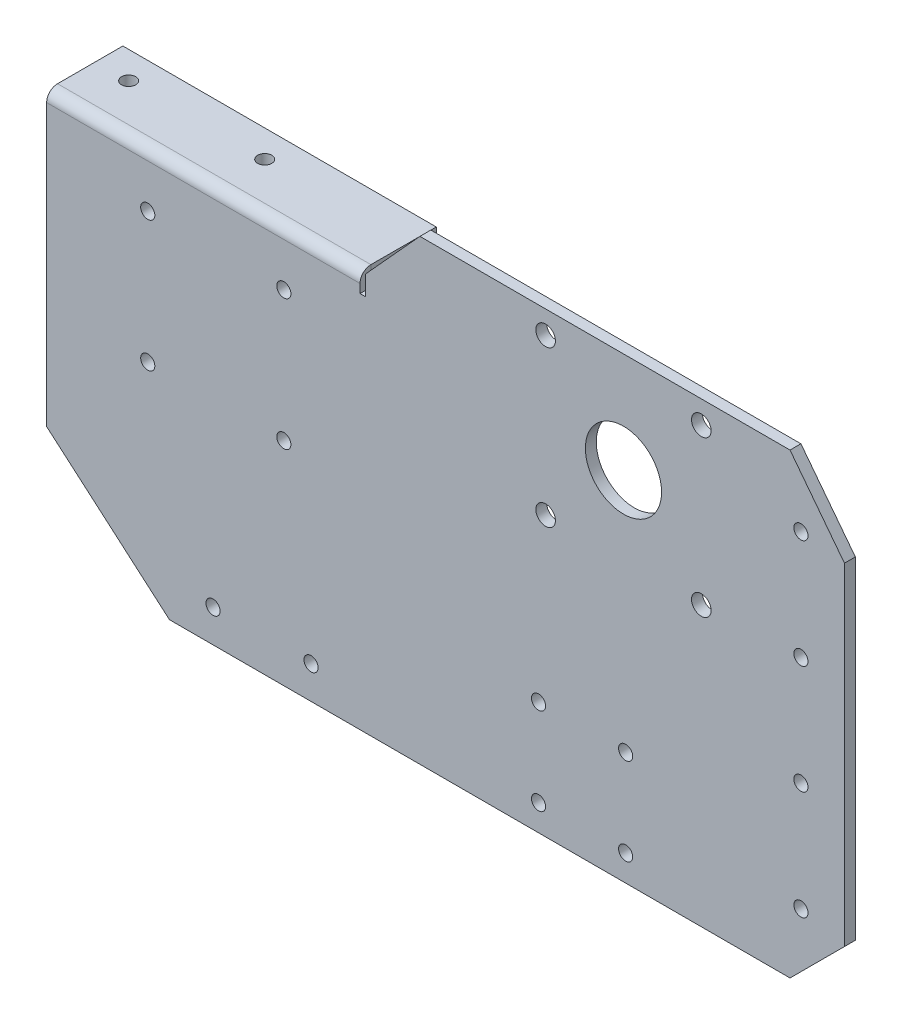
ISO-10303-21;
HEADER;
FILE_DESCRIPTION(('STEP AP214'),'2;1');
FILE_NAME('part.step','',(''),(''),'','','');
FILE_SCHEMA(('AUTOMOTIVE_DESIGN { 1 0 10303 214 1 1 1 1 }'));
ENDSEC;
DATA;
#1=APPLICATION_CONTEXT('core data for automotive mechanical design processes');
#2=APPLICATION_PROTOCOL_DEFINITION('international standard','automotive_design',2000,#1);
#3=PRODUCT_CONTEXT('',#1,'mechanical');
#4=PRODUCT('Part','Part','',(#3));
#5=PRODUCT_RELATED_PRODUCT_CATEGORY('part','',(#4));
#6=PRODUCT_DEFINITION_FORMATION('','',#4);
#7=PRODUCT_DEFINITION_CONTEXT('part definition',#1,'design');
#8=PRODUCT_DEFINITION('design','',#6,#7);
#9=PRODUCT_DEFINITION_SHAPE('','',#8);
#10=(LENGTH_UNIT() NAMED_UNIT(*) SI_UNIT(.MILLI.,.METRE.));
#11=(NAMED_UNIT(*) PLANE_ANGLE_UNIT() SI_UNIT($,.RADIAN.));
#12=(NAMED_UNIT(*) SI_UNIT($,.STERADIAN.) SOLID_ANGLE_UNIT());
#13=UNCERTAINTY_MEASURE_WITH_UNIT(LENGTH_MEASURE(1.E-05),#10,'distance_accuracy_value','');
#14=(GEOMETRIC_REPRESENTATION_CONTEXT(3) GLOBAL_UNCERTAINTY_ASSIGNED_CONTEXT((#13)) GLOBAL_UNIT_ASSIGNED_CONTEXT((#10,
#11,#12)) REPRESENTATION_CONTEXT('',''));
#15=CARTESIAN_POINT('',(0.,0.,0.));
#16=DIRECTION('',(0.,0.,1.));
#17=DIRECTION('',(1.,0.,0.));
#18=AXIS2_PLACEMENT_3D('',#15,#16,#17);
#19=CARTESIAN_POINT('',(67.1428269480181,97.1807045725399,-1145.39074847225));
#20=DIRECTION('',(-1.,0.,0.));
#21=DIRECTION('',(0.,0.,1.));
#22=AXIS2_PLACEMENT_3D('',#19,#20,#21);
#23=PLANE('',#22);
#24=DIRECTION('',(0.,0.,1.));
#25=VECTOR('',#24,1.);
#26=CARTESIAN_POINT('',(67.1428269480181,97.1807045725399,-1145.39074847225));
#27=LINE('',#26,#25);
#28=CARTESIAN_POINT('',(67.1428269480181,97.1807045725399,0.));
#29=VERTEX_POINT('',#28);
#30=CARTESIAN_POINT('',(67.1428269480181,97.1807045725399,10.));
#31=VERTEX_POINT('',#30);
#32=EDGE_CURVE('E54',#29,#31,#27,.T.);
#33=ORIENTED_EDGE('',*,*,#32,.T.);
#34=DIRECTION('',(0.,1.,0.));
#35=VECTOR('',#34,1.);
#36=CARTESIAN_POINT('',(67.1428269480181,73.3276118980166,10.));
#37=LINE('',#36,#35);
#38=CARTESIAN_POINT('',(67.1428269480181,354.999,10.));
#39=VERTEX_POINT('',#38);
#40=EDGE_CURVE('E47',#31,#39,#37,.T.);
#41=ORIENTED_EDGE('',*,*,#40,.T.);
#42=CARTESIAN_POINT('',(67.1428269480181,354.999,0.));
#43=DIRECTION('',(-1.,0.,0.));
#44=DIRECTION('',(0.,0.,1.));
#45=AXIS2_PLACEMENT_3D('',#42,#43,#44);
#46=CIRCLE('',#45,10.);
#47=CARTESIAN_POINT('',(67.1428269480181,364.999,0.));
#48=VERTEX_POINT('',#47);
#49=EDGE_CURVE('E165',#48,#39,#46,.F.);
#50=ORIENTED_EDGE('',*,*,#49,.F.);
#51=DIRECTION('',(0.,0.,-1.));
#52=VECTOR('',#51,1.);
#53=CARTESIAN_POINT('',(67.1428269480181,364.999,10.));
#54=LINE('',#53,#52);
#55=CARTESIAN_POINT('',(67.1428269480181,364.999,-60.));
#56=VERTEX_POINT('',#55);
#57=EDGE_CURVE('E166',#48,#56,#54,.T.);
#58=ORIENTED_EDGE('',*,*,#57,.T.);
#59=DIRECTION('',(0.,1.,0.));
#60=VECTOR('',#59,1.);
#61=CARTESIAN_POINT('',(67.1428269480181,354.999,-60.));
#62=LINE('',#61,#60);
#63=CARTESIAN_POINT('',(67.142826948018,354.999,-60.));
#64=VERTEX_POINT('',#63);
#65=EDGE_CURVE('E172',#64,#56,#62,.T.);
#66=ORIENTED_EDGE('',*,*,#65,.F.);
#67=DIRECTION('',(0.,0.,1.));
#68=VECTOR('',#67,1.);
#69=CARTESIAN_POINT('',(67.142826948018,354.999,10.));
#70=LINE('',#69,#68);
#71=CARTESIAN_POINT('',(67.142826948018,354.999,-10.));
#72=VERTEX_POINT('',#71);
#73=EDGE_CURVE('E170',#64,#72,#70,.T.);
#74=ORIENTED_EDGE('',*,*,#73,.T.);
#75=CARTESIAN_POINT('',(67.1428269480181,344.999,-10.));
#76=DIRECTION('',(-1.,0.,0.));
#77=DIRECTION('',(0.,0.,1.));
#78=AXIS2_PLACEMENT_3D('',#75,#76,#77);
#79=CIRCLE('',#78,10.);
#80=CARTESIAN_POINT('',(67.1428269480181,344.999,0.));
#81=VERTEX_POINT('',#80);
#82=EDGE_CURVE('E11',#72,#81,#79,.F.);
#83=ORIENTED_EDGE('',*,*,#82,.T.);
#84=DIRECTION('',(0.,1.,0.));
#85=VECTOR('',#84,1.);
#86=CARTESIAN_POINT('',(67.1428269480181,73.3276118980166,0.));
#87=LINE('',#86,#85);
#88=EDGE_CURVE('E160',#29,#81,#87,.T.);
#89=ORIENTED_EDGE('',*,*,#88,.F.);
#90=EDGE_LOOP('',(#33,#41,#50,#58,#66,#74,#83,#89));
#91=FACE_BOUND('',#90,.T.);
#92=ADVANCED_FACE('F32',(#91),#23,.T.);
#93=CARTESIAN_POINT('',(94.8431926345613,73.3276118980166,10.));
#94=DIRECTION('',(0.,0.,-1.));
#95=DIRECTION('',(-1.,0.,0.));
#96=AXIS2_PLACEMENT_3D('',#93,#94,#95);
#97=PLANE('',#96);
#98=CARTESIAN_POINT('',(759.999,59.999,10.));
#99=DIRECTION('',(0.,0.,1.));
#100=DIRECTION('',(1.,0.,0.));
#101=AXIS2_PLACEMENT_3D('',#98,#99,#100);
#102=CIRCLE('',#101,6.49999999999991);
#103=CARTESIAN_POINT('',(766.499,59.999,10.));
#104=VERTEX_POINT('',#103);
#105=EDGE_CURVE('E208',#104,#104,#102,.T.);
#106=ORIENTED_EDGE('',*,*,#105,.F.);
#107=EDGE_LOOP('',(#106));
#108=FACE_BOUND('',#107,.T.);
#109=CARTESIAN_POINT('',(284.999,314.999,10.));
#110=DIRECTION('',(0.,0.,1.));
#111=DIRECTION('',(1.,0.,0.));
#112=AXIS2_PLACEMENT_3D('',#109,#110,#111);
#113=CIRCLE('',#112,6.50000000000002);
#114=CARTESIAN_POINT('',(291.499,314.999,10.));
#115=VERTEX_POINT('',#114);
#116=EDGE_CURVE('E220',#115,#115,#113,.T.);
#117=ORIENTED_EDGE('',*,*,#116,.F.);
#118=EDGE_LOOP('',(#117));
#119=FACE_BOUND('',#118,.T.);
#120=CARTESIAN_POINT('',(159.999,194.999,10.));
#121=DIRECTION('',(0.,0.,1.));
#122=DIRECTION('',(1.,0.,0.));
#123=AXIS2_PLACEMENT_3D('',#120,#121,#122);
#124=CIRCLE('',#123,6.50000000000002);
#125=CARTESIAN_POINT('',(166.499,194.999,10.));
#126=VERTEX_POINT('',#125);
#127=EDGE_CURVE('E238',#126,#126,#124,.T.);
#128=ORIENTED_EDGE('',*,*,#127,.F.);
#129=EDGE_LOOP('',(#128));
#130=FACE_BOUND('',#129,.T.);
#131=CARTESIAN_POINT('',(219.999,29.9989999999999,10.));
#132=DIRECTION('',(0.,0.,1.));
#133=DIRECTION('',(1.,0.,0.));
#134=AXIS2_PLACEMENT_3D('',#131,#132,#133);
#135=CIRCLE('',#134,6.50000000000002);
#136=CARTESIAN_POINT('',(226.499,29.9989999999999,10.));
#137=VERTEX_POINT('',#136);
#138=EDGE_CURVE('E244',#137,#137,#135,.T.);
#139=ORIENTED_EDGE('',*,*,#138,.F.);
#140=EDGE_LOOP('',(#139));
#141=FACE_BOUND('',#140,.T.);
#142=CARTESIAN_POINT('',(518.999,23.999,10.));
#143=DIRECTION('',(0.,0.,1.));
#144=DIRECTION('',(1.,0.,0.));
#145=AXIS2_PLACEMENT_3D('',#142,#143,#144);
#146=CIRCLE('',#145,6.50000000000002);
#147=CARTESIAN_POINT('',(525.499,23.999,10.));
#148=VERTEX_POINT('',#147);
#149=EDGE_CURVE('E256',#148,#148,#146,.T.);
#150=ORIENTED_EDGE('',*,*,#149,.F.);
#151=EDGE_LOOP('',(#150));
#152=FACE_BOUND('',#151,.T.);
#153=CARTESIAN_POINT('',(598.999,23.999,10.));
#154=DIRECTION('',(0.,0.,1.));
#155=DIRECTION('',(1.,0.,0.));
#156=AXIS2_PLACEMENT_3D('',#153,#154,#155);
#157=CIRCLE('',#156,6.4999999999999);
#158=CARTESIAN_POINT('',(605.499,23.999,10.));
#159=VERTEX_POINT('',#158);
#160=EDGE_CURVE('E268',#159,#159,#157,.T.);
#161=ORIENTED_EDGE('',*,*,#160,.F.);
#162=EDGE_LOOP('',(#161));
#163=FACE_BOUND('',#162,.T.);
#164=CARTESIAN_POINT('',(596.999,327.499,10.));
#165=DIRECTION('',(0.,0.,1.));
#166=DIRECTION('',(1.,0.,0.));
#167=AXIS2_PLACEMENT_3D('',#164,#165,#166);
#168=CIRCLE('',#167,35.);
#169=CARTESIAN_POINT('',(631.999,327.499,10.));
#170=VERTEX_POINT('',#169);
#171=EDGE_CURVE('E280',#170,#170,#168,.T.);
#172=ORIENTED_EDGE('',*,*,#171,.F.);
#173=EDGE_LOOP('',(#172));
#174=FACE_BOUND('',#173,.T.);
#175=CARTESIAN_POINT('',(525.499,255.999,10.));
#176=DIRECTION('',(0.,0.,1.));
#177=DIRECTION('',(1.,0.,0.));
#178=AXIS2_PLACEMENT_3D('',#175,#176,#177);
#179=CIRCLE('',#178,9.00000000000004);
#180=CARTESIAN_POINT('',(534.499,255.999,10.));
#181=VERTEX_POINT('',#180);
#182=EDGE_CURVE('E292',#181,#181,#179,.T.);
#183=ORIENTED_EDGE('',*,*,#182,.F.);
#184=EDGE_LOOP('',(#183));
#185=FACE_BOUND('',#184,.T.);
#186=CARTESIAN_POINT('',(668.499,255.999,10.));
#187=DIRECTION('',(0.,0.,1.));
#188=DIRECTION('',(1.,0.,0.));
#189=AXIS2_PLACEMENT_3D('',#186,#187,#188);
#190=CIRCLE('',#189,9.00000000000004);
#191=CARTESIAN_POINT('',(677.499,255.999,10.));
#192=VERTEX_POINT('',#191);
#193=EDGE_CURVE('E304',#192,#192,#190,.T.);
#194=ORIENTED_EDGE('',*,*,#193,.F.);
#195=EDGE_LOOP('',(#194));
#196=FACE_BOUND('',#195,.T.);
#197=CARTESIAN_POINT('',(759.999,359.999,10.));
#198=DIRECTION('',(0.,0.,1.));
#199=DIRECTION('',(1.,0.,0.));
#200=AXIS2_PLACEMENT_3D('',#197,#198,#199);
#201=CIRCLE('',#200,6.49999999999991);
#202=CARTESIAN_POINT('',(766.499,359.999,10.));
#203=VERTEX_POINT('',#202);
#204=EDGE_CURVE('E316',#203,#203,#201,.T.);
#205=ORIENTED_EDGE('',*,*,#204,.F.);
#206=EDGE_LOOP('',(#205));
#207=FACE_BOUND('',#206,.T.);
#208=CARTESIAN_POINT('',(668.499,398.999,10.));
#209=DIRECTION('',(0.,0.,1.));
#210=DIRECTION('',(1.,0.,0.));
#211=AXIS2_PLACEMENT_3D('',#208,#209,#210);
#212=CIRCLE('',#211,9.00000000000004);
#213=CARTESIAN_POINT('',(677.499,398.999,10.));
#214=VERTEX_POINT('',#213);
#215=EDGE_CURVE('E310',#214,#214,#212,.T.);
#216=ORIENTED_EDGE('',*,*,#215,.F.);
#217=EDGE_LOOP('',(#216));
#218=FACE_BOUND('',#217,.T.);
#219=CARTESIAN_POINT('',(525.499,398.999,10.));
#220=DIRECTION('',(0.,0.,1.));
#221=DIRECTION('',(1.,0.,0.));
#222=AXIS2_PLACEMENT_3D('',#219,#220,#221);
#223=CIRCLE('',#222,9.00000000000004);
#224=CARTESIAN_POINT('',(534.499,398.999,10.));
#225=VERTEX_POINT('',#224);
#226=EDGE_CURVE('E298',#225,#225,#223,.T.);
#227=ORIENTED_EDGE('',*,*,#226,.F.);
#228=EDGE_LOOP('',(#227));
#229=FACE_BOUND('',#228,.T.);
#230=CARTESIAN_POINT('',(759.999,259.999,10.));
#231=DIRECTION('',(0.,0.,1.));
#232=DIRECTION('',(1.,0.,0.));
#233=AXIS2_PLACEMENT_3D('',#230,#231,#232);
#234=CIRCLE('',#233,6.49999999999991);
#235=CARTESIAN_POINT('',(766.499,259.999,10.));
#236=VERTEX_POINT('',#235);
#237=EDGE_CURVE('E286',#236,#236,#234,.T.);
#238=ORIENTED_EDGE('',*,*,#237,.F.);
#239=EDGE_LOOP('',(#238));
#240=FACE_BOUND('',#239,.T.);
#241=CARTESIAN_POINT('',(598.999,103.999,10.));
#242=DIRECTION('',(0.,0.,1.));
#243=DIRECTION('',(1.,0.,0.));
#244=AXIS2_PLACEMENT_3D('',#241,#242,#243);
#245=CIRCLE('',#244,6.4999999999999);
#246=CARTESIAN_POINT('',(605.499,103.999,10.));
#247=VERTEX_POINT('',#246);
#248=EDGE_CURVE('E274',#247,#247,#245,.T.);
#249=ORIENTED_EDGE('',*,*,#248,.F.);
#250=EDGE_LOOP('',(#249));
#251=FACE_BOUND('',#250,.T.);
#252=CARTESIAN_POINT('',(518.999,103.999,10.));
#253=DIRECTION('',(0.,0.,1.));
#254=DIRECTION('',(1.,0.,0.));
#255=AXIS2_PLACEMENT_3D('',#252,#253,#254);
#256=CIRCLE('',#255,6.50000000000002);
#257=CARTESIAN_POINT('',(525.499,103.999,10.));
#258=VERTEX_POINT('',#257);
#259=EDGE_CURVE('E262',#258,#258,#256,.T.);
#260=ORIENTED_EDGE('',*,*,#259,.F.);
#261=EDGE_LOOP('',(#260));
#262=FACE_BOUND('',#261,.T.);
#263=CARTESIAN_POINT('',(309.999,29.9989999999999,10.));
#264=DIRECTION('',(0.,0.,1.));
#265=DIRECTION('',(1.,0.,0.));
#266=AXIS2_PLACEMENT_3D('',#263,#264,#265);
#267=CIRCLE('',#266,6.50000000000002);
#268=CARTESIAN_POINT('',(316.499,29.9989999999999,10.));
#269=VERTEX_POINT('',#268);
#270=EDGE_CURVE('E250',#269,#269,#267,.T.);
#271=ORIENTED_EDGE('',*,*,#270,.F.);
#272=EDGE_LOOP('',(#271));
#273=FACE_BOUND('',#272,.T.);
#274=CARTESIAN_POINT('',(284.999,194.999,10.));
#275=DIRECTION('',(0.,0.,1.));
#276=DIRECTION('',(1.,0.,0.));
#277=AXIS2_PLACEMENT_3D('',#274,#275,#276);
#278=CIRCLE('',#277,6.50000000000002);
#279=CARTESIAN_POINT('',(291.499,194.999,10.));
#280=VERTEX_POINT('',#279);
#281=EDGE_CURVE('E232',#280,#280,#278,.T.);
#282=ORIENTED_EDGE('',*,*,#281,.F.);
#283=EDGE_LOOP('',(#282));
#284=FACE_BOUND('',#283,.T.);
#285=CARTESIAN_POINT('',(159.999,314.999,10.));
#286=DIRECTION('',(0.,0.,1.));
#287=DIRECTION('',(1.,0.,0.));
#288=AXIS2_PLACEMENT_3D('',#285,#286,#287);
#289=CIRCLE('',#288,6.50000000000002);
#290=CARTESIAN_POINT('',(166.499,314.999,10.));
#291=VERTEX_POINT('',#290);
#292=EDGE_CURVE('E226',#291,#291,#289,.T.);
#293=ORIENTED_EDGE('',*,*,#292,.F.);
#294=EDGE_LOOP('',(#293));
#295=FACE_BOUND('',#294,.T.);
#296=CARTESIAN_POINT('',(759.999,159.999,10.));
#297=DIRECTION('',(0.,0.,1.));
#298=DIRECTION('',(1.,0.,0.));
#299=AXIS2_PLACEMENT_3D('',#296,#297,#298);
#300=CIRCLE('',#299,6.49999999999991);
#301=CARTESIAN_POINT('',(766.499,159.999,10.));
#302=VERTEX_POINT('',#301);
#303=EDGE_CURVE('E214',#302,#302,#300,.T.);
#304=ORIENTED_EDGE('',*,*,#303,.F.);
#305=EDGE_LOOP('',(#304));
#306=FACE_BOUND('',#305,.T.);
#307=ORIENTED_EDGE('',*,*,#40,.F.);
#308=DIRECTION('',(0.757768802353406,-0.652523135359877,0.));
#309=VECTOR('',#308,1.);
#310=CARTESIAN_POINT('',(179.999,-0.0010000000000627,10.));
#311=LINE('',#310,#309);
#312=CARTESIAN_POINT('',(179.999,-0.0010000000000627,10.));
#313=VERTEX_POINT('',#312);
#314=EDGE_CURVE('E341',#31,#313,#311,.T.);
#315=ORIENTED_EDGE('',*,*,#314,.T.);
#316=DIRECTION('',(1.,0.,0.));
#317=VECTOR('',#316,1.);
#318=CARTESIAN_POINT('',(749.999,-0.000999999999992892,10.));
#319=LINE('',#318,#317);
#320=CARTESIAN_POINT('',(749.999,-0.000999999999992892,10.));
#321=VERTEX_POINT('',#320);
#322=EDGE_CURVE('E343',#313,#321,#319,.T.);
#323=ORIENTED_EDGE('',*,*,#322,.T.);
#324=DIRECTION('',(0.707106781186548,0.707106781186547,0.));
#325=VECTOR('',#324,1.);
#326=CARTESIAN_POINT('',(799.999,49.999,10.));
#327=LINE('',#326,#325);
#328=CARTESIAN_POINT('',(799.999,49.999,10.));
#329=VERTEX_POINT('',#328);
#330=EDGE_CURVE('E345',#321,#329,#327,.T.);
#331=ORIENTED_EDGE('',*,*,#330,.T.);
#332=DIRECTION('',(0.,1.,0.));
#333=VECTOR('',#332,1.);
#334=CARTESIAN_POINT('',(799.999,354.999,10.));
#335=LINE('',#334,#333);
#336=CARTESIAN_POINT('',(799.999,354.999,10.));
#337=VERTEX_POINT('',#336);
#338=EDGE_CURVE('E347',#329,#337,#335,.T.);
#339=ORIENTED_EDGE('',*,*,#338,.T.);
#340=DIRECTION('',(-0.609710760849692,0.792623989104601,0.));
#341=VECTOR('',#340,1.);
#342=CARTESIAN_POINT('',(749.999,419.999,10.));
#343=LINE('',#342,#341);
#344=CARTESIAN_POINT('',(749.999,419.999,10.));
#345=VERTEX_POINT('',#344);
#346=EDGE_CURVE('E349',#337,#345,#343,.T.);
#347=ORIENTED_EDGE('',*,*,#346,.T.);
#348=DIRECTION('',(-1.,0.,0.));
#349=VECTOR('',#348,1.);
#350=CARTESIAN_POINT('',(409.999,419.999,10.));
#351=LINE('',#350,#349);
#352=CARTESIAN_POINT('',(409.999,419.999,10.));
#353=VERTEX_POINT('',#352);
#354=EDGE_CURVE('E351',#345,#353,#351,.T.);
#355=ORIENTED_EDGE('',*,*,#354,.T.);
#356=DIRECTION('',(-0.672672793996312,-0.739940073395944,0.));
#357=VECTOR('',#356,1.);
#358=CARTESIAN_POINT('',(359.999,364.999,10.));
#359=LINE('',#358,#357);
#360=CARTESIAN_POINT('',(359.999,364.999,10.));
#361=VERTEX_POINT('',#360);
#362=EDGE_CURVE('E353',#353,#361,#359,.T.);
#363=ORIENTED_EDGE('',*,*,#362,.T.);
#364=DIRECTION('',(0.,-1.,0.));
#365=VECTOR('',#364,1.);
#366=CARTESIAN_POINT('',(359.999,346.999,10.));
#367=LINE('',#366,#365);
#368=CARTESIAN_POINT('',(359.999,346.999,10.));
#369=VERTEX_POINT('',#368);
#370=EDGE_CURVE('E355',#361,#369,#367,.T.);
#371=ORIENTED_EDGE('',*,*,#370,.T.);
#372=DIRECTION('',(-1.,0.,0.));
#373=VECTOR('',#372,1.);
#374=CARTESIAN_POINT('',(354.999,346.999,10.));
#375=LINE('',#374,#373);
#376=CARTESIAN_POINT('',(354.999,346.999,10.));
#377=VERTEX_POINT('',#376);
#378=EDGE_CURVE('E357',#369,#377,#375,.T.);
#379=ORIENTED_EDGE('',*,*,#378,.T.);
#380=DIRECTION('',(0.,1.,0.));
#381=VECTOR('',#380,1.);
#382=CARTESIAN_POINT('',(354.999,364.999,10.));
#383=LINE('',#382,#381);
#384=CARTESIAN_POINT('',(354.999,354.999,10.));
#385=VERTEX_POINT('',#384);
#386=EDGE_CURVE('E359',#377,#385,#383,.T.);
#387=ORIENTED_EDGE('',*,*,#386,.T.);
#388=DIRECTION('',(-1.,0.,0.));
#389=VECTOR('',#388,1.);
#390=CARTESIAN_POINT('',(94.8431926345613,354.999,10.));
#391=LINE('',#390,#389);
#392=EDGE_CURVE('E389',#385,#39,#391,.T.);
#393=ORIENTED_EDGE('',*,*,#392,.T.);
#394=EDGE_LOOP('',(#307,#315,#323,#331,#339,#347,#355,#363,#371,#379,#387,#393));
#395=FACE_BOUND('',#394,.T.);
#396=ADVANCED_FACE('F459',(#108,#119,#130,#141,#152,#163,#174,#185,#196,#207,#218,#229,#240,
#251,#262,#273,#284,#295,#306,#395),#97,.F.);
#397=CARTESIAN_POINT('',(94.8431926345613,73.3276118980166,0.));
#398=DIRECTION('',(0.,0.,-1.));
#399=DIRECTION('',(-1.,0.,0.));
#400=AXIS2_PLACEMENT_3D('',#397,#398,#399);
#401=PLANE('',#400);
#402=CARTESIAN_POINT('',(759.999,59.999,0.));
#403=DIRECTION('',(0.,0.,1.));
#404=DIRECTION('',(1.,0.,0.));
#405=AXIS2_PLACEMENT_3D('',#402,#403,#404);
#406=CIRCLE('',#405,6.49999999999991);
#407=CARTESIAN_POINT('',(766.499,59.999,0.));
#408=VERTEX_POINT('',#407);
#409=EDGE_CURVE('E205',#408,#408,#406,.T.);
#410=ORIENTED_EDGE('',*,*,#409,.T.);
#411=EDGE_LOOP('',(#410));
#412=FACE_BOUND('',#411,.T.);
#413=CARTESIAN_POINT('',(284.999,314.999,0.));
#414=DIRECTION('',(0.,0.,1.));
#415=DIRECTION('',(1.,0.,0.));
#416=AXIS2_PLACEMENT_3D('',#413,#414,#415);
#417=CIRCLE('',#416,6.50000000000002);
#418=CARTESIAN_POINT('',(291.499,314.999,0.));
#419=VERTEX_POINT('',#418);
#420=EDGE_CURVE('E217',#419,#419,#417,.T.);
#421=ORIENTED_EDGE('',*,*,#420,.T.);
#422=EDGE_LOOP('',(#421));
#423=FACE_BOUND('',#422,.T.);
#424=CARTESIAN_POINT('',(159.999,194.999,0.));
#425=DIRECTION('',(0.,0.,1.));
#426=DIRECTION('',(1.,0.,0.));
#427=AXIS2_PLACEMENT_3D('',#424,#425,#426);
#428=CIRCLE('',#427,6.50000000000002);
#429=CARTESIAN_POINT('',(166.499,194.999,0.));
#430=VERTEX_POINT('',#429);
#431=EDGE_CURVE('E235',#430,#430,#428,.T.);
#432=ORIENTED_EDGE('',*,*,#431,.T.);
#433=EDGE_LOOP('',(#432));
#434=FACE_BOUND('',#433,.T.);
#435=CARTESIAN_POINT('',(219.999,29.9989999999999,0.));
#436=DIRECTION('',(0.,0.,1.));
#437=DIRECTION('',(1.,0.,0.));
#438=AXIS2_PLACEMENT_3D('',#435,#436,#437);
#439=CIRCLE('',#438,6.50000000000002);
#440=CARTESIAN_POINT('',(226.499,29.9989999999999,0.));
#441=VERTEX_POINT('',#440);
#442=EDGE_CURVE('E241',#441,#441,#439,.T.);
#443=ORIENTED_EDGE('',*,*,#442,.T.);
#444=EDGE_LOOP('',(#443));
#445=FACE_BOUND('',#444,.T.);
#446=CARTESIAN_POINT('',(518.999,23.999,0.));
#447=DIRECTION('',(0.,0.,1.));
#448=DIRECTION('',(1.,0.,0.));
#449=AXIS2_PLACEMENT_3D('',#446,#447,#448);
#450=CIRCLE('',#449,6.50000000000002);
#451=CARTESIAN_POINT('',(525.499,23.999,0.));
#452=VERTEX_POINT('',#451);
#453=EDGE_CURVE('E253',#452,#452,#450,.T.);
#454=ORIENTED_EDGE('',*,*,#453,.T.);
#455=EDGE_LOOP('',(#454));
#456=FACE_BOUND('',#455,.T.);
#457=CARTESIAN_POINT('',(598.999,23.999,0.));
#458=DIRECTION('',(0.,0.,1.));
#459=DIRECTION('',(1.,0.,0.));
#460=AXIS2_PLACEMENT_3D('',#457,#458,#459);
#461=CIRCLE('',#460,6.4999999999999);
#462=CARTESIAN_POINT('',(605.499,23.999,0.));
#463=VERTEX_POINT('',#462);
#464=EDGE_CURVE('E265',#463,#463,#461,.T.);
#465=ORIENTED_EDGE('',*,*,#464,.T.);
#466=EDGE_LOOP('',(#465));
#467=FACE_BOUND('',#466,.T.);
#468=CARTESIAN_POINT('',(596.999,327.499,0.));
#469=DIRECTION('',(0.,0.,1.));
#470=DIRECTION('',(1.,0.,0.));
#471=AXIS2_PLACEMENT_3D('',#468,#469,#470);
#472=CIRCLE('',#471,35.);
#473=CARTESIAN_POINT('',(631.999,327.499,0.));
#474=VERTEX_POINT('',#473);
#475=EDGE_CURVE('E277',#474,#474,#472,.T.);
#476=ORIENTED_EDGE('',*,*,#475,.T.);
#477=EDGE_LOOP('',(#476));
#478=FACE_BOUND('',#477,.T.);
#479=CARTESIAN_POINT('',(525.499,255.999,0.));
#480=DIRECTION('',(0.,0.,1.));
#481=DIRECTION('',(1.,0.,0.));
#482=AXIS2_PLACEMENT_3D('',#479,#480,#481);
#483=CIRCLE('',#482,9.00000000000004);
#484=CARTESIAN_POINT('',(534.499,255.999,0.));
#485=VERTEX_POINT('',#484);
#486=EDGE_CURVE('E289',#485,#485,#483,.T.);
#487=ORIENTED_EDGE('',*,*,#486,.T.);
#488=EDGE_LOOP('',(#487));
#489=FACE_BOUND('',#488,.T.);
#490=CARTESIAN_POINT('',(668.499,255.999,0.));
#491=DIRECTION('',(0.,0.,1.));
#492=DIRECTION('',(1.,0.,0.));
#493=AXIS2_PLACEMENT_3D('',#490,#491,#492);
#494=CIRCLE('',#493,9.00000000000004);
#495=CARTESIAN_POINT('',(677.499,255.999,0.));
#496=VERTEX_POINT('',#495);
#497=EDGE_CURVE('E301',#496,#496,#494,.T.);
#498=ORIENTED_EDGE('',*,*,#497,.T.);
#499=EDGE_LOOP('',(#498));
#500=FACE_BOUND('',#499,.T.);
#501=CARTESIAN_POINT('',(759.999,359.999,0.));
#502=DIRECTION('',(0.,0.,1.));
#503=DIRECTION('',(1.,0.,0.));
#504=AXIS2_PLACEMENT_3D('',#501,#502,#503);
#505=CIRCLE('',#504,6.49999999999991);
#506=CARTESIAN_POINT('',(766.499,359.999,0.));
#507=VERTEX_POINT('',#506);
#508=EDGE_CURVE('E313',#507,#507,#505,.T.);
#509=ORIENTED_EDGE('',*,*,#508,.T.);
#510=EDGE_LOOP('',(#509));
#511=FACE_BOUND('',#510,.T.);
#512=CARTESIAN_POINT('',(668.499,398.999,0.));
#513=DIRECTION('',(0.,0.,1.));
#514=DIRECTION('',(1.,0.,0.));
#515=AXIS2_PLACEMENT_3D('',#512,#513,#514);
#516=CIRCLE('',#515,9.00000000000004);
#517=CARTESIAN_POINT('',(677.499,398.999,0.));
#518=VERTEX_POINT('',#517);
#519=EDGE_CURVE('E307',#518,#518,#516,.T.);
#520=ORIENTED_EDGE('',*,*,#519,.T.);
#521=EDGE_LOOP('',(#520));
#522=FACE_BOUND('',#521,.T.);
#523=CARTESIAN_POINT('',(525.499,398.999,0.));
#524=DIRECTION('',(0.,0.,1.));
#525=DIRECTION('',(1.,0.,0.));
#526=AXIS2_PLACEMENT_3D('',#523,#524,#525);
#527=CIRCLE('',#526,9.00000000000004);
#528=CARTESIAN_POINT('',(534.499,398.999,0.));
#529=VERTEX_POINT('',#528);
#530=EDGE_CURVE('E295',#529,#529,#527,.T.);
#531=ORIENTED_EDGE('',*,*,#530,.T.);
#532=EDGE_LOOP('',(#531));
#533=FACE_BOUND('',#532,.T.);
#534=CARTESIAN_POINT('',(759.999,259.999,0.));
#535=DIRECTION('',(0.,0.,1.));
#536=DIRECTION('',(1.,0.,0.));
#537=AXIS2_PLACEMENT_3D('',#534,#535,#536);
#538=CIRCLE('',#537,6.49999999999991);
#539=CARTESIAN_POINT('',(766.499,259.999,0.));
#540=VERTEX_POINT('',#539);
#541=EDGE_CURVE('E283',#540,#540,#538,.T.);
#542=ORIENTED_EDGE('',*,*,#541,.T.);
#543=EDGE_LOOP('',(#542));
#544=FACE_BOUND('',#543,.T.);
#545=CARTESIAN_POINT('',(598.999,103.999,0.));
#546=DIRECTION('',(0.,0.,1.));
#547=DIRECTION('',(1.,0.,0.));
#548=AXIS2_PLACEMENT_3D('',#545,#546,#547);
#549=CIRCLE('',#548,6.4999999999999);
#550=CARTESIAN_POINT('',(605.499,103.999,0.));
#551=VERTEX_POINT('',#550);
#552=EDGE_CURVE('E271',#551,#551,#549,.T.);
#553=ORIENTED_EDGE('',*,*,#552,.T.);
#554=EDGE_LOOP('',(#553));
#555=FACE_BOUND('',#554,.T.);
#556=CARTESIAN_POINT('',(518.999,103.999,0.));
#557=DIRECTION('',(0.,0.,1.));
#558=DIRECTION('',(1.,0.,0.));
#559=AXIS2_PLACEMENT_3D('',#556,#557,#558);
#560=CIRCLE('',#559,6.50000000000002);
#561=CARTESIAN_POINT('',(525.499,103.999,0.));
#562=VERTEX_POINT('',#561);
#563=EDGE_CURVE('E259',#562,#562,#560,.T.);
#564=ORIENTED_EDGE('',*,*,#563,.T.);
#565=EDGE_LOOP('',(#564));
#566=FACE_BOUND('',#565,.T.);
#567=CARTESIAN_POINT('',(309.999,29.9989999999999,0.));
#568=DIRECTION('',(0.,0.,1.));
#569=DIRECTION('',(1.,0.,0.));
#570=AXIS2_PLACEMENT_3D('',#567,#568,#569);
#571=CIRCLE('',#570,6.50000000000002);
#572=CARTESIAN_POINT('',(316.499,29.9989999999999,0.));
#573=VERTEX_POINT('',#572);
#574=EDGE_CURVE('E247',#573,#573,#571,.T.);
#575=ORIENTED_EDGE('',*,*,#574,.T.);
#576=EDGE_LOOP('',(#575));
#577=FACE_BOUND('',#576,.T.);
#578=CARTESIAN_POINT('',(284.999,194.999,0.));
#579=DIRECTION('',(0.,0.,1.));
#580=DIRECTION('',(1.,0.,0.));
#581=AXIS2_PLACEMENT_3D('',#578,#579,#580);
#582=CIRCLE('',#581,6.50000000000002);
#583=CARTESIAN_POINT('',(291.499,194.999,0.));
#584=VERTEX_POINT('',#583);
#585=EDGE_CURVE('E229',#584,#584,#582,.T.);
#586=ORIENTED_EDGE('',*,*,#585,.T.);
#587=EDGE_LOOP('',(#586));
#588=FACE_BOUND('',#587,.T.);
#589=CARTESIAN_POINT('',(159.999,314.999,0.));
#590=DIRECTION('',(0.,0.,1.));
#591=DIRECTION('',(1.,0.,0.));
#592=AXIS2_PLACEMENT_3D('',#589,#590,#591);
#593=CIRCLE('',#592,6.50000000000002);
#594=CARTESIAN_POINT('',(166.499,314.999,0.));
#595=VERTEX_POINT('',#594);
#596=EDGE_CURVE('E223',#595,#595,#593,.T.);
#597=ORIENTED_EDGE('',*,*,#596,.T.);
#598=EDGE_LOOP('',(#597));
#599=FACE_BOUND('',#598,.T.);
#600=CARTESIAN_POINT('',(759.999,159.999,0.));
#601=DIRECTION('',(0.,0.,1.));
#602=DIRECTION('',(1.,0.,0.));
#603=AXIS2_PLACEMENT_3D('',#600,#601,#602);
#604=CIRCLE('',#603,6.49999999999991);
#605=CARTESIAN_POINT('',(766.499,159.999,0.));
#606=VERTEX_POINT('',#605);
#607=EDGE_CURVE('E211',#606,#606,#604,.T.);
#608=ORIENTED_EDGE('',*,*,#607,.T.);
#609=EDGE_LOOP('',(#608));
#610=FACE_BOUND('',#609,.T.);
#611=DIRECTION('',(0.757768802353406,-0.652523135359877,0.));
#612=VECTOR('',#611,1.);
#613=CARTESIAN_POINT('',(179.999,-0.0010000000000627,0.));
#614=LINE('',#613,#612);
#615=CARTESIAN_POINT('',(179.999,-0.0010000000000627,0.));
#616=VERTEX_POINT('',#615);
#617=EDGE_CURVE('E163',#29,#616,#614,.T.);
#618=ORIENTED_EDGE('',*,*,#617,.F.);
#619=ORIENTED_EDGE('',*,*,#88,.T.);
#620=DIRECTION('',(1.,0.,0.));
#621=VECTOR('',#620,1.);
#622=CARTESIAN_POINT('',(94.8431926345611,344.999,0.));
#623=LINE('',#622,#621);
#624=CARTESIAN_POINT('',(354.977821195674,344.999,0.));
#625=VERTEX_POINT('',#624);
#626=EDGE_CURVE('E148',#81,#625,#623,.T.);
#627=ORIENTED_EDGE('',*,*,#626,.T.);
#628=DIRECTION('',(0.,-1.,0.));
#629=VECTOR('',#628,1.);
#630=CARTESIAN_POINT('',(354.977821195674,73.3276118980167,0.));
#631=LINE('',#630,#629);
#632=CARTESIAN_POINT('',(354.977821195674,364.999,0.));
#633=VERTEX_POINT('',#632);
#634=EDGE_CURVE('E203',#633,#625,#631,.T.);
#635=ORIENTED_EDGE('',*,*,#634,.F.);
#636=DIRECTION('',(-1.,0.,0.));
#637=VECTOR('',#636,1.);
#638=CARTESIAN_POINT('',(-0.001000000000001,364.999,0.));
#639=LINE('',#638,#637);
#640=CARTESIAN_POINT('',(354.999,364.999,0.));
#641=VERTEX_POINT('',#640);
#642=EDGE_CURVE('E338',#641,#633,#639,.T.);
#643=ORIENTED_EDGE('',*,*,#642,.F.);
#644=DIRECTION('',(0.,1.,0.));
#645=VECTOR('',#644,1.);
#646=CARTESIAN_POINT('',(354.999,364.999,0.));
#647=LINE('',#646,#645);
#648=CARTESIAN_POINT('',(354.999,346.999,0.));
#649=VERTEX_POINT('',#648);
#650=EDGE_CURVE('E336',#649,#641,#647,.T.);
#651=ORIENTED_EDGE('',*,*,#650,.F.);
#652=DIRECTION('',(-1.,0.,0.));
#653=VECTOR('',#652,1.);
#654=CARTESIAN_POINT('',(354.999,346.999,0.));
#655=LINE('',#654,#653);
#656=CARTESIAN_POINT('',(359.999,346.999,0.));
#657=VERTEX_POINT('',#656);
#658=EDGE_CURVE('E334',#657,#649,#655,.T.);
#659=ORIENTED_EDGE('',*,*,#658,.F.);
#660=DIRECTION('',(0.,-1.,0.));
#661=VECTOR('',#660,1.);
#662=CARTESIAN_POINT('',(359.999,346.999,0.));
#663=LINE('',#662,#661);
#664=CARTESIAN_POINT('',(359.999,364.999,0.));
#665=VERTEX_POINT('',#664);
#666=EDGE_CURVE('E332',#665,#657,#663,.T.);
#667=ORIENTED_EDGE('',*,*,#666,.F.);
#668=DIRECTION('',(-0.672672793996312,-0.739940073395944,0.));
#669=VECTOR('',#668,1.);
#670=CARTESIAN_POINT('',(359.999,364.999,0.));
#671=LINE('',#670,#669);
#672=CARTESIAN_POINT('',(409.999,419.999,0.));
#673=VERTEX_POINT('',#672);
#674=EDGE_CURVE('E330',#673,#665,#671,.T.);
#675=ORIENTED_EDGE('',*,*,#674,.F.);
#676=DIRECTION('',(-1.,0.,0.));
#677=VECTOR('',#676,1.);
#678=CARTESIAN_POINT('',(409.999,419.999,0.));
#679=LINE('',#678,#677);
#680=CARTESIAN_POINT('',(749.999,419.999,0.));
#681=VERTEX_POINT('',#680);
#682=EDGE_CURVE('E328',#681,#673,#679,.T.);
#683=ORIENTED_EDGE('',*,*,#682,.F.);
#684=DIRECTION('',(-0.609710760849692,0.792623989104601,0.));
#685=VECTOR('',#684,1.);
#686=CARTESIAN_POINT('',(749.999,419.999,0.));
#687=LINE('',#686,#685);
#688=CARTESIAN_POINT('',(799.999,354.999,0.));
#689=VERTEX_POINT('',#688);
#690=EDGE_CURVE('E326',#689,#681,#687,.T.);
#691=ORIENTED_EDGE('',*,*,#690,.F.);
#692=DIRECTION('',(0.,1.,0.));
#693=VECTOR('',#692,1.);
#694=CARTESIAN_POINT('',(799.999,354.999,0.));
#695=LINE('',#694,#693);
#696=CARTESIAN_POINT('',(799.999,49.999,0.));
#697=VERTEX_POINT('',#696);
#698=EDGE_CURVE('E324',#697,#689,#695,.T.);
#699=ORIENTED_EDGE('',*,*,#698,.F.);
#700=DIRECTION('',(0.707106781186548,0.707106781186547,0.));
#701=VECTOR('',#700,1.);
#702=CARTESIAN_POINT('',(799.999,49.999,0.));
#703=LINE('',#702,#701);
#704=CARTESIAN_POINT('',(749.999,-0.000999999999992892,0.));
#705=VERTEX_POINT('',#704);
#706=EDGE_CURVE('E322',#705,#697,#703,.T.);
#707=ORIENTED_EDGE('',*,*,#706,.F.);
#708=DIRECTION('',(1.,0.,0.));
#709=VECTOR('',#708,1.);
#710=CARTESIAN_POINT('',(749.999,-0.000999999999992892,0.));
#711=LINE('',#710,#709);
#712=EDGE_CURVE('E320',#616,#705,#711,.T.);
#713=ORIENTED_EDGE('',*,*,#712,.F.);
#714=EDGE_LOOP('',(#618,#619,#627,#635,#643,#651,#659,#667,#675,#683,#691,#699,#707,#713));
#715=FACE_BOUND('',#714,.T.);
#716=ADVANCED_FACE('F161',(#412,#423,#434,#445,#456,#467,#478,#489,#500,#511,#522,#533,#544,
#555,#566,#577,#588,#599,#610,#715),#401,.T.);
#717=CARTESIAN_POINT('',(179.999,-0.0010000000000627,10.));
#718=DIRECTION('',(0.652523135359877,0.757768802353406,0.));
#719=DIRECTION('',(-0.757768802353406,0.652523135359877,0.));
#720=AXIS2_PLACEMENT_3D('',#717,#718,#719);
#721=PLANE('',#720);
#722=ORIENTED_EDGE('',*,*,#32,.F.);
#723=ORIENTED_EDGE('',*,*,#617,.T.);
#724=DIRECTION('',(0.,0.,-1.));
#725=VECTOR('',#724,1.);
#726=CARTESIAN_POINT('',(179.999,-0.0010000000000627,10.));
#727=LINE('',#726,#725);
#728=EDGE_CURVE('E386',#313,#616,#727,.T.);
#729=ORIENTED_EDGE('',*,*,#728,.F.);
#730=ORIENTED_EDGE('',*,*,#314,.F.);
#731=EDGE_LOOP('',(#722,#723,#729,#730));
#732=FACE_BOUND('',#731,.T.);
#733=ADVANCED_FACE('F34',(#732),#721,.F.);
#734=CARTESIAN_POINT('',(-0.001000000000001,364.999,10.));
#735=DIRECTION('',(0.,-1.,0.));
#736=DIRECTION('',(0.,0.,-1.));
#737=AXIS2_PLACEMENT_3D('',#734,#735,#736);
#738=PLANE('',#737);
#739=CARTESIAN_POINT('',(97.4349233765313,364.999,-35.));
#740=DIRECTION('',(0.,1.,0.));
#741=DIRECTION('',(-1.,0.,0.));
#742=AXIS2_PLACEMENT_3D('',#739,#740,#741);
#743=CIRCLE('',#742,6.5);
#744=CARTESIAN_POINT('',(90.9349233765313,364.999,-35.));
#745=VERTEX_POINT('',#744);
#746=EDGE_CURVE('E187',#745,#745,#743,.T.);
#747=ORIENTED_EDGE('',*,*,#746,.F.);
#748=EDGE_LOOP('',(#747));
#749=FACE_BOUND('',#748,.T.);
#750=CARTESIAN_POINT('',(222.434923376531,364.999,-35.));
#751=DIRECTION('',(0.,1.,0.));
#752=DIRECTION('',(-1.,0.,0.));
#753=AXIS2_PLACEMENT_3D('',#750,#751,#752);
#754=CIRCLE('',#753,6.50000000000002);
#755=CARTESIAN_POINT('',(215.934923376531,364.999,-35.));
#756=VERTEX_POINT('',#755);
#757=EDGE_CURVE('E183',#756,#756,#754,.T.);
#758=ORIENTED_EDGE('',*,*,#757,.F.);
#759=EDGE_LOOP('',(#758));
#760=FACE_BOUND('',#759,.T.);
#761=ORIENTED_EDGE('',*,*,#57,.F.);
#762=DIRECTION('',(-1.,0.,0.));
#763=VECTOR('',#762,1.);
#764=CARTESIAN_POINT('',(-0.001000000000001,364.999,0.));
#765=LINE('',#764,#763);
#766=EDGE_CURVE('E395',#48,#633,#765,.F.);
#767=ORIENTED_EDGE('',*,*,#766,.T.);
#768=DIRECTION('',(0.00160626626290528,0.,-0.999998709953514));
#769=VECTOR('',#768,1.);
#770=CARTESIAN_POINT('',(354.961758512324,364.999,10.));
#771=LINE('',#770,#769);
#772=CARTESIAN_POINT('',(355.074197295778,364.999,-60.));
#773=VERTEX_POINT('',#772);
#774=EDGE_CURVE('E191',#633,#773,#771,.T.);
#775=ORIENTED_EDGE('',*,*,#774,.T.);
#776=DIRECTION('',(-1.,0.,0.));
#777=VECTOR('',#776,1.);
#778=CARTESIAN_POINT('',(355.074197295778,364.999,-60.));
#779=LINE('',#778,#777);
#780=EDGE_CURVE('E193',#773,#56,#779,.T.);
#781=ORIENTED_EDGE('',*,*,#780,.T.);
#782=EDGE_LOOP('',(#761,#767,#775,#781));
#783=FACE_BOUND('',#782,.T.);
#784=ADVANCED_FACE('F474',(#749,#760,#783),#738,.F.);
#785=CARTESIAN_POINT('',(355.074197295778,354.999,-60.));
#786=DIRECTION('',(0.,0.,-1.));
#787=DIRECTION('',(-1.,0.,0.));
#788=AXIS2_PLACEMENT_3D('',#785,#786,#787);
#789=PLANE('',#788);
#790=DIRECTION('',(-1.,0.,0.));
#791=VECTOR('',#790,1.);
#792=CARTESIAN_POINT('',(355.074197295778,354.999,-60.));
#793=LINE('',#792,#791);
#794=CARTESIAN_POINT('',(355.074197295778,354.999,-60.));
#795=VERTEX_POINT('',#794);
#796=EDGE_CURVE('E198',#795,#64,#793,.T.);
#797=ORIENTED_EDGE('',*,*,#796,.T.);
#798=ORIENTED_EDGE('',*,*,#65,.T.);
#799=ORIENTED_EDGE('',*,*,#780,.F.);
#800=DIRECTION('',(0.,1.,0.));
#801=VECTOR('',#800,1.);
#802=CARTESIAN_POINT('',(355.074197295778,354.999,-60.));
#803=LINE('',#802,#801);
#804=EDGE_CURVE('E200',#795,#773,#803,.T.);
#805=ORIENTED_EDGE('',*,*,#804,.F.);
#806=EDGE_LOOP('',(#797,#798,#799,#805));
#807=FACE_BOUND('',#806,.T.);
#808=ADVANCED_FACE('F405',(#807),#789,.T.);
#809=CARTESIAN_POINT('',(354.961758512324,354.999,10.));
#810=DIRECTION('',(0.,1.,0.));
#811=DIRECTION('',(-1.,0.,0.));
#812=AXIS2_PLACEMENT_3D('',#809,#810,#811);
#813=PLANE('',#812);
#814=CARTESIAN_POINT('',(97.4349233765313,354.999,-35.));
#815=DIRECTION('',(0.,1.,0.));
#816=DIRECTION('',(-1.,0.,0.));
#817=AXIS2_PLACEMENT_3D('',#814,#815,#816);
#818=CIRCLE('',#817,6.5);
#819=CARTESIAN_POINT('',(90.9349233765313,354.999,-35.));
#820=VERTEX_POINT('',#819);
#821=EDGE_CURVE('E190',#820,#820,#818,.T.);
#822=ORIENTED_EDGE('',*,*,#821,.T.);
#823=EDGE_LOOP('',(#822));
#824=FACE_BOUND('',#823,.T.);
#825=CARTESIAN_POINT('',(222.434923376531,354.999,-35.));
#826=DIRECTION('',(0.,1.,0.));
#827=DIRECTION('',(-1.,0.,0.));
#828=AXIS2_PLACEMENT_3D('',#825,#826,#827);
#829=CIRCLE('',#828,6.50000000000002);
#830=CARTESIAN_POINT('',(215.934923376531,354.999,-35.));
#831=VERTEX_POINT('',#830);
#832=EDGE_CURVE('E186',#831,#831,#829,.T.);
#833=ORIENTED_EDGE('',*,*,#832,.T.);
#834=EDGE_LOOP('',(#833));
#835=FACE_BOUND('',#834,.T.);
#836=ORIENTED_EDGE('',*,*,#73,.F.);
#837=ORIENTED_EDGE('',*,*,#796,.F.);
#838=DIRECTION('',(0.00160626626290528,0.,-0.999998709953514));
#839=VECTOR('',#838,1.);
#840=CARTESIAN_POINT('',(354.961758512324,354.999,10.));
#841=LINE('',#840,#839);
#842=CARTESIAN_POINT('',(354.993883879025,354.999,-10.));
#843=VERTEX_POINT('',#842);
#844=EDGE_CURVE('E196',#843,#795,#841,.T.);
#845=ORIENTED_EDGE('',*,*,#844,.F.);
#846=DIRECTION('',(1.,0.,0.));
#847=VECTOR('',#846,1.);
#848=CARTESIAN_POINT('',(354.961758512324,354.999,-10.));
#849=LINE('',#848,#847);
#850=EDGE_CURVE('E156',#843,#72,#849,.F.);
#851=ORIENTED_EDGE('',*,*,#850,.T.);
#852=EDGE_LOOP('',(#836,#837,#845,#851));
#853=FACE_BOUND('',#852,.T.);
#854=ADVANCED_FACE('F403',(#824,#835,#853),#813,.F.);
#855=CARTESIAN_POINT('',(94.8431926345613,354.999,0.));
#856=DIRECTION('',(-1.,0.,0.));
#857=DIRECTION('',(0.,0.,1.));
#858=AXIS2_PLACEMENT_3D('',#855,#856,#857);
#859=CYLINDRICAL_SURFACE('',#858,10.);
#860=ORIENTED_EDGE('',*,*,#766,.F.);
#861=ORIENTED_EDGE('',*,*,#49,.T.);
#862=ORIENTED_EDGE('',*,*,#392,.F.);
#863=CARTESIAN_POINT('',(354.999,354.999,0.));
#864=DIRECTION('',(-1.,0.,0.));
#865=DIRECTION('',(0.,0.,1.));
#866=AXIS2_PLACEMENT_3D('',#863,#864,#865);
#867=CIRCLE('',#866,10.);
#868=EDGE_CURVE('E157',#641,#385,#867,.F.);
#869=ORIENTED_EDGE('',*,*,#868,.F.);
#870=ORIENTED_EDGE('',*,*,#642,.T.);
#871=EDGE_LOOP('',(#860,#861,#862,#869,#870));
#872=FACE_BOUND('',#871,.T.);
#873=ADVANCED_FACE('F412',(#872),#859,.T.);
#874=CARTESIAN_POINT('',(94.8431926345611,344.999,-10.));
#875=DIRECTION('',(1.,0.,0.));
#876=DIRECTION('',(0.,1.,0.));
#877=AXIS2_PLACEMENT_3D('',#874,#875,#876);
#878=CYLINDRICAL_SURFACE('',#877,10.);
#879=ORIENTED_EDGE('',*,*,#82,.F.);
#880=ORIENTED_EDGE('',*,*,#850,.F.);
#881=CARTESIAN_POINT('',(354.993883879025,344.999,-10.));
#882=DIRECTION('',(0.999998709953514,0.,0.00160626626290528));
#883=DIRECTION('',(0.00160626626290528,0.,-0.999998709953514));
#884=AXIS2_PLACEMENT_3D('',#881,#882,#883);
#885=ELLIPSE('',#884,10.0000129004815,10.);
#886=EDGE_CURVE('E40',#625,#843,#885,.F.);
#887=ORIENTED_EDGE('',*,*,#886,.F.);
#888=ORIENTED_EDGE('',*,*,#626,.F.);
#889=EDGE_LOOP('',(#879,#880,#887,#888));
#890=FACE_BOUND('',#889,.T.);
#891=ADVANCED_FACE('F150',(#890),#878,.F.);
#892=CARTESIAN_POINT('',(749.999,-0.000999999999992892,10.));
#893=DIRECTION('',(0.,1.,0.));
#894=DIRECTION('',(-1.,0.,0.));
#895=AXIS2_PLACEMENT_3D('',#892,#893,#894);
#896=PLANE('',#895);
#897=ORIENTED_EDGE('',*,*,#712,.T.);
#898=DIRECTION('',(0.,0.,-1.));
#899=VECTOR('',#898,1.);
#900=CARTESIAN_POINT('',(749.999,-0.000999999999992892,10.));
#901=LINE('',#900,#899);
#902=EDGE_CURVE('E383',#321,#705,#901,.T.);
#903=ORIENTED_EDGE('',*,*,#902,.F.);
#904=ORIENTED_EDGE('',*,*,#322,.F.);
#905=ORIENTED_EDGE('',*,*,#728,.T.);
#906=EDGE_LOOP('',(#897,#903,#904,#905));
#907=FACE_BOUND('',#906,.T.);
#908=ADVANCED_FACE('F457',(#907),#896,.F.);
#909=CARTESIAN_POINT('',(799.999,49.999,10.));
#910=DIRECTION('',(-0.707106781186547,0.707106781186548,0.));
#911=DIRECTION('',(-0.707106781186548,-0.707106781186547,0.));
#912=AXIS2_PLACEMENT_3D('',#909,#910,#911);
#913=PLANE('',#912);
#914=ORIENTED_EDGE('',*,*,#706,.T.);
#915=DIRECTION('',(0.,0.,-1.));
#916=VECTOR('',#915,1.);
#917=CARTESIAN_POINT('',(799.999,49.999,10.));
#918=LINE('',#917,#916);
#919=EDGE_CURVE('E380',#329,#697,#918,.T.);
#920=ORIENTED_EDGE('',*,*,#919,.F.);
#921=ORIENTED_EDGE('',*,*,#330,.F.);
#922=ORIENTED_EDGE('',*,*,#902,.T.);
#923=EDGE_LOOP('',(#914,#920,#921,#922));
#924=FACE_BOUND('',#923,.T.);
#925=ADVANCED_FACE('F453',(#924),#913,.F.);
#926=CARTESIAN_POINT('',(799.999,354.999,10.));
#927=DIRECTION('',(-1.,0.,0.));
#928=DIRECTION('',(0.,0.,1.));
#929=AXIS2_PLACEMENT_3D('',#926,#927,#928);
#930=PLANE('',#929);
#931=ORIENTED_EDGE('',*,*,#698,.T.);
#932=DIRECTION('',(0.,0.,-1.));
#933=VECTOR('',#932,1.);
#934=CARTESIAN_POINT('',(799.999,354.999,10.));
#935=LINE('',#934,#933);
#936=EDGE_CURVE('E377',#337,#689,#935,.T.);
#937=ORIENTED_EDGE('',*,*,#936,.F.);
#938=ORIENTED_EDGE('',*,*,#338,.F.);
#939=ORIENTED_EDGE('',*,*,#919,.T.);
#940=EDGE_LOOP('',(#931,#937,#938,#939));
#941=FACE_BOUND('',#940,.T.);
#942=ADVANCED_FACE('F448',(#941),#930,.F.);
#943=CARTESIAN_POINT('',(749.999,419.999,10.));
#944=DIRECTION('',(-0.792623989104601,-0.609710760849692,0.));
#945=DIRECTION('',(0.609710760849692,-0.792623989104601,0.));
#946=AXIS2_PLACEMENT_3D('',#943,#944,#945);
#947=PLANE('',#946);
#948=ORIENTED_EDGE('',*,*,#690,.T.);
#949=DIRECTION('',(0.,0.,-1.));
#950=VECTOR('',#949,1.);
#951=CARTESIAN_POINT('',(749.999,419.999,10.));
#952=LINE('',#951,#950);
#953=EDGE_CURVE('E374',#345,#681,#952,.T.);
#954=ORIENTED_EDGE('',*,*,#953,.F.);
#955=ORIENTED_EDGE('',*,*,#346,.F.);
#956=ORIENTED_EDGE('',*,*,#936,.T.);
#957=EDGE_LOOP('',(#948,#954,#955,#956));
#958=FACE_BOUND('',#957,.T.);
#959=ADVANCED_FACE('F443',(#958),#947,.F.);
#960=CARTESIAN_POINT('',(409.999,419.999,10.));
#961=DIRECTION('',(0.,-1.,0.));
#962=DIRECTION('',(0.,0.,-1.));
#963=AXIS2_PLACEMENT_3D('',#960,#961,#962);
#964=PLANE('',#963);
#965=ORIENTED_EDGE('',*,*,#682,.T.);
#966=DIRECTION('',(0.,0.,-1.));
#967=VECTOR('',#966,1.);
#968=CARTESIAN_POINT('',(409.999,419.999,10.));
#969=LINE('',#968,#967);
#970=EDGE_CURVE('E371',#353,#673,#969,.T.);
#971=ORIENTED_EDGE('',*,*,#970,.F.);
#972=ORIENTED_EDGE('',*,*,#354,.F.);
#973=ORIENTED_EDGE('',*,*,#953,.T.);
#974=EDGE_LOOP('',(#965,#971,#972,#973));
#975=FACE_BOUND('',#974,.T.);
#976=ADVANCED_FACE('F439',(#975),#964,.F.);
#977=CARTESIAN_POINT('',(359.999,364.999,10.));
#978=DIRECTION('',(0.739940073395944,-0.672672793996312,0.));
#979=DIRECTION('',(0.672672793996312,0.739940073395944,0.));
#980=AXIS2_PLACEMENT_3D('',#977,#978,#979);
#981=PLANE('',#980);
#982=ORIENTED_EDGE('',*,*,#674,.T.);
#983=DIRECTION('',(0.,0.,-1.));
#984=VECTOR('',#983,1.);
#985=CARTESIAN_POINT('',(359.999,364.999,10.));
#986=LINE('',#985,#984);
#987=EDGE_CURVE('E368',#361,#665,#986,.T.);
#988=ORIENTED_EDGE('',*,*,#987,.F.);
#989=ORIENTED_EDGE('',*,*,#362,.F.);
#990=ORIENTED_EDGE('',*,*,#970,.T.);
#991=EDGE_LOOP('',(#982,#988,#989,#990));
#992=FACE_BOUND('',#991,.T.);
#993=ADVANCED_FACE('F434',(#992),#981,.F.);
#994=CARTESIAN_POINT('',(359.999,346.999,10.));
#995=DIRECTION('',(1.,0.,0.));
#996=DIRECTION('',(0.,0.,-1.));
#997=AXIS2_PLACEMENT_3D('',#994,#995,#996);
#998=PLANE('',#997);
#999=ORIENTED_EDGE('',*,*,#666,.T.);
#1000=DIRECTION('',(0.,0.,-1.));
#1001=VECTOR('',#1000,1.);
#1002=CARTESIAN_POINT('',(359.999,346.999,10.));
#1003=LINE('',#1002,#1001);
#1004=EDGE_CURVE('E365',#369,#657,#1003,.T.);
#1005=ORIENTED_EDGE('',*,*,#1004,.F.);
#1006=ORIENTED_EDGE('',*,*,#370,.F.);
#1007=ORIENTED_EDGE('',*,*,#987,.T.);
#1008=EDGE_LOOP('',(#999,#1005,#1006,#1007));
#1009=FACE_BOUND('',#1008,.T.);
#1010=ADVANCED_FACE('F428',(#1009),#998,.F.);
#1011=CARTESIAN_POINT('',(354.999,346.999,10.));
#1012=DIRECTION('',(0.,-1.,0.));
#1013=DIRECTION('',(0.,0.,-1.));
#1014=AXIS2_PLACEMENT_3D('',#1011,#1012,#1013);
#1015=PLANE('',#1014);
#1016=ORIENTED_EDGE('',*,*,#658,.T.);
#1017=DIRECTION('',(0.,0.,-1.));
#1018=VECTOR('',#1017,1.);
#1019=CARTESIAN_POINT('',(354.999,346.999,10.));
#1020=LINE('',#1019,#1018);
#1021=EDGE_CURVE('E362',#377,#649,#1020,.T.);
#1022=ORIENTED_EDGE('',*,*,#1021,.F.);
#1023=ORIENTED_EDGE('',*,*,#378,.F.);
#1024=ORIENTED_EDGE('',*,*,#1004,.T.);
#1025=EDGE_LOOP('',(#1016,#1022,#1023,#1024));
#1026=FACE_BOUND('',#1025,.T.);
#1027=ADVANCED_FACE('F424',(#1026),#1015,.F.);
#1028=CARTESIAN_POINT('',(354.999,364.999,10.));
#1029=DIRECTION('',(-1.,0.,0.));
#1030=DIRECTION('',(0.,0.,1.));
#1031=AXIS2_PLACEMENT_3D('',#1028,#1029,#1030);
#1032=PLANE('',#1031);
#1033=ORIENTED_EDGE('',*,*,#650,.T.);
#1034=ORIENTED_EDGE('',*,*,#868,.T.);
#1035=ORIENTED_EDGE('',*,*,#386,.F.);
#1036=ORIENTED_EDGE('',*,*,#1021,.T.);
#1037=EDGE_LOOP('',(#1033,#1034,#1035,#1036));
#1038=FACE_BOUND('',#1037,.T.);
#1039=ADVANCED_FACE('F419',(#1038),#1032,.F.);
#1040=CARTESIAN_POINT('',(759.999,359.999,10.));
#1041=DIRECTION('',(0.,0.,-1.));
#1042=DIRECTION('',(-1.,0.,0.));
#1043=AXIS2_PLACEMENT_3D('',#1040,#1041,#1042);
#1044=CYLINDRICAL_SURFACE('',#1043,6.49999999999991);
#1045=ORIENTED_EDGE('',*,*,#204,.T.);
#1046=EDGE_LOOP('',(#1045));
#1047=FACE_BOUND('',#1046,.T.);
#1048=ORIENTED_EDGE('',*,*,#508,.F.);
#1049=EDGE_LOOP('',(#1048));
#1050=FACE_BOUND('',#1049,.T.);
#1051=ADVANCED_FACE('F480',(#1047,#1050),#1044,.F.);
#1052=CARTESIAN_POINT('',(668.499,398.999,10.));
#1053=DIRECTION('',(0.,0.,-1.));
#1054=DIRECTION('',(-1.,0.,0.));
#1055=AXIS2_PLACEMENT_3D('',#1052,#1053,#1054);
#1056=CYLINDRICAL_SURFACE('',#1055,9.00000000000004);
#1057=ORIENTED_EDGE('',*,*,#215,.T.);
#1058=EDGE_LOOP('',(#1057));
#1059=FACE_BOUND('',#1058,.T.);
#1060=ORIENTED_EDGE('',*,*,#519,.F.);
#1061=EDGE_LOOP('',(#1060));
#1062=FACE_BOUND('',#1061,.T.);
#1063=ADVANCED_FACE('F586',(#1059,#1062),#1056,.F.);
#1064=CARTESIAN_POINT('',(668.499,255.999,10.));
#1065=DIRECTION('',(0.,0.,-1.));
#1066=DIRECTION('',(-1.,0.,0.));
#1067=AXIS2_PLACEMENT_3D('',#1064,#1065,#1066);
#1068=CYLINDRICAL_SURFACE('',#1067,9.00000000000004);
#1069=ORIENTED_EDGE('',*,*,#193,.T.);
#1070=EDGE_LOOP('',(#1069));
#1071=FACE_BOUND('',#1070,.T.);
#1072=ORIENTED_EDGE('',*,*,#497,.F.);
#1073=EDGE_LOOP('',(#1072));
#1074=FACE_BOUND('',#1073,.T.);
#1075=ADVANCED_FACE('F582',(#1071,#1074),#1068,.F.);
#1076=CARTESIAN_POINT('',(525.499,398.999,10.));
#1077=DIRECTION('',(0.,0.,-1.));
#1078=DIRECTION('',(-1.,0.,0.));
#1079=AXIS2_PLACEMENT_3D('',#1076,#1077,#1078);
#1080=CYLINDRICAL_SURFACE('',#1079,9.00000000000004);
#1081=ORIENTED_EDGE('',*,*,#226,.T.);
#1082=EDGE_LOOP('',(#1081));
#1083=FACE_BOUND('',#1082,.T.);
#1084=ORIENTED_EDGE('',*,*,#530,.F.);
#1085=EDGE_LOOP('',(#1084));
#1086=FACE_BOUND('',#1085,.T.);
#1087=ADVANCED_FACE('F578',(#1083,#1086),#1080,.F.);
#1088=CARTESIAN_POINT('',(525.499,255.999,10.));
#1089=DIRECTION('',(0.,0.,-1.));
#1090=DIRECTION('',(-1.,0.,0.));
#1091=AXIS2_PLACEMENT_3D('',#1088,#1089,#1090);
#1092=CYLINDRICAL_SURFACE('',#1091,9.00000000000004);
#1093=ORIENTED_EDGE('',*,*,#182,.T.);
#1094=EDGE_LOOP('',(#1093));
#1095=FACE_BOUND('',#1094,.T.);
#1096=ORIENTED_EDGE('',*,*,#486,.F.);
#1097=EDGE_LOOP('',(#1096));
#1098=FACE_BOUND('',#1097,.T.);
#1099=ADVANCED_FACE('F574',(#1095,#1098),#1092,.F.);
#1100=CARTESIAN_POINT('',(759.999,259.999,10.));
#1101=DIRECTION('',(0.,0.,-1.));
#1102=DIRECTION('',(-1.,0.,0.));
#1103=AXIS2_PLACEMENT_3D('',#1100,#1101,#1102);
#1104=CYLINDRICAL_SURFACE('',#1103,6.49999999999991);
#1105=ORIENTED_EDGE('',*,*,#237,.T.);
#1106=EDGE_LOOP('',(#1105));
#1107=FACE_BOUND('',#1106,.T.);
#1108=ORIENTED_EDGE('',*,*,#541,.F.);
#1109=EDGE_LOOP('',(#1108));
#1110=FACE_BOUND('',#1109,.T.);
#1111=ADVANCED_FACE('F570',(#1107,#1110),#1104,.F.);
#1112=CARTESIAN_POINT('',(596.999,327.499,10.));
#1113=DIRECTION('',(0.,0.,-1.));
#1114=DIRECTION('',(-1.,0.,0.));
#1115=AXIS2_PLACEMENT_3D('',#1112,#1113,#1114);
#1116=CYLINDRICAL_SURFACE('',#1115,35.);
#1117=ORIENTED_EDGE('',*,*,#171,.T.);
#1118=EDGE_LOOP('',(#1117));
#1119=FACE_BOUND('',#1118,.T.);
#1120=ORIENTED_EDGE('',*,*,#475,.F.);
#1121=EDGE_LOOP('',(#1120));
#1122=FACE_BOUND('',#1121,.T.);
#1123=ADVANCED_FACE('F566',(#1119,#1122),#1116,.F.);
#1124=CARTESIAN_POINT('',(598.999,103.999,10.));
#1125=DIRECTION('',(0.,0.,-1.));
#1126=DIRECTION('',(-1.,0.,0.));
#1127=AXIS2_PLACEMENT_3D('',#1124,#1125,#1126);
#1128=CYLINDRICAL_SURFACE('',#1127,6.4999999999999);
#1129=ORIENTED_EDGE('',*,*,#248,.T.);
#1130=EDGE_LOOP('',(#1129));
#1131=FACE_BOUND('',#1130,.T.);
#1132=ORIENTED_EDGE('',*,*,#552,.F.);
#1133=EDGE_LOOP('',(#1132));
#1134=FACE_BOUND('',#1133,.T.);
#1135=ADVANCED_FACE('F562',(#1131,#1134),#1128,.F.);
#1136=CARTESIAN_POINT('',(598.999,23.999,10.));
#1137=DIRECTION('',(0.,0.,-1.));
#1138=DIRECTION('',(-1.,0.,0.));
#1139=AXIS2_PLACEMENT_3D('',#1136,#1137,#1138);
#1140=CYLINDRICAL_SURFACE('',#1139,6.4999999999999);
#1141=ORIENTED_EDGE('',*,*,#160,.T.);
#1142=EDGE_LOOP('',(#1141));
#1143=FACE_BOUND('',#1142,.T.);
#1144=ORIENTED_EDGE('',*,*,#464,.F.);
#1145=EDGE_LOOP('',(#1144));
#1146=FACE_BOUND('',#1145,.T.);
#1147=ADVANCED_FACE('F558',(#1143,#1146),#1140,.F.);
#1148=CARTESIAN_POINT('',(518.999,103.999,10.));
#1149=DIRECTION('',(0.,0.,-1.));
#1150=DIRECTION('',(-1.,0.,0.));
#1151=AXIS2_PLACEMENT_3D('',#1148,#1149,#1150);
#1152=CYLINDRICAL_SURFACE('',#1151,6.50000000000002);
#1153=ORIENTED_EDGE('',*,*,#259,.T.);
#1154=EDGE_LOOP('',(#1153));
#1155=FACE_BOUND('',#1154,.T.);
#1156=ORIENTED_EDGE('',*,*,#563,.F.);
#1157=EDGE_LOOP('',(#1156));
#1158=FACE_BOUND('',#1157,.T.);
#1159=ADVANCED_FACE('F554',(#1155,#1158),#1152,.F.);
#1160=CARTESIAN_POINT('',(518.999,23.999,10.));
#1161=DIRECTION('',(0.,0.,-1.));
#1162=DIRECTION('',(-1.,0.,0.));
#1163=AXIS2_PLACEMENT_3D('',#1160,#1161,#1162);
#1164=CYLINDRICAL_SURFACE('',#1163,6.50000000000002);
#1165=ORIENTED_EDGE('',*,*,#149,.T.);
#1166=EDGE_LOOP('',(#1165));
#1167=FACE_BOUND('',#1166,.T.);
#1168=ORIENTED_EDGE('',*,*,#453,.F.);
#1169=EDGE_LOOP('',(#1168));
#1170=FACE_BOUND('',#1169,.T.);
#1171=ADVANCED_FACE('F550',(#1167,#1170),#1164,.F.);
#1172=CARTESIAN_POINT('',(309.999,29.9989999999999,10.));
#1173=DIRECTION('',(0.,0.,-1.));
#1174=DIRECTION('',(-1.,0.,0.));
#1175=AXIS2_PLACEMENT_3D('',#1172,#1173,#1174);
#1176=CYLINDRICAL_SURFACE('',#1175,6.50000000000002);
#1177=ORIENTED_EDGE('',*,*,#270,.T.);
#1178=EDGE_LOOP('',(#1177));
#1179=FACE_BOUND('',#1178,.T.);
#1180=ORIENTED_EDGE('',*,*,#574,.F.);
#1181=EDGE_LOOP('',(#1180));
#1182=FACE_BOUND('',#1181,.T.);
#1183=ADVANCED_FACE('F546',(#1179,#1182),#1176,.F.);
#1184=CARTESIAN_POINT('',(219.999,29.9989999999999,10.));
#1185=DIRECTION('',(0.,0.,-1.));
#1186=DIRECTION('',(-1.,0.,0.));
#1187=AXIS2_PLACEMENT_3D('',#1184,#1185,#1186);
#1188=CYLINDRICAL_SURFACE('',#1187,6.50000000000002);
#1189=ORIENTED_EDGE('',*,*,#138,.T.);
#1190=EDGE_LOOP('',(#1189));
#1191=FACE_BOUND('',#1190,.T.);
#1192=ORIENTED_EDGE('',*,*,#442,.F.);
#1193=EDGE_LOOP('',(#1192));
#1194=FACE_BOUND('',#1193,.T.);
#1195=ADVANCED_FACE('F542',(#1191,#1194),#1188,.F.);
#1196=CARTESIAN_POINT('',(159.999,194.999,10.));
#1197=DIRECTION('',(0.,0.,-1.));
#1198=DIRECTION('',(-1.,0.,0.));
#1199=AXIS2_PLACEMENT_3D('',#1196,#1197,#1198);
#1200=CYLINDRICAL_SURFACE('',#1199,6.50000000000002);
#1201=ORIENTED_EDGE('',*,*,#127,.T.);
#1202=EDGE_LOOP('',(#1201));
#1203=FACE_BOUND('',#1202,.T.);
#1204=ORIENTED_EDGE('',*,*,#431,.F.);
#1205=EDGE_LOOP('',(#1204));
#1206=FACE_BOUND('',#1205,.T.);
#1207=ADVANCED_FACE('F538',(#1203,#1206),#1200,.F.);
#1208=CARTESIAN_POINT('',(284.999,194.999,10.));
#1209=DIRECTION('',(0.,0.,-1.));
#1210=DIRECTION('',(-1.,0.,0.));
#1211=AXIS2_PLACEMENT_3D('',#1208,#1209,#1210);
#1212=CYLINDRICAL_SURFACE('',#1211,6.50000000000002);
#1213=ORIENTED_EDGE('',*,*,#281,.T.);
#1214=EDGE_LOOP('',(#1213));
#1215=FACE_BOUND('',#1214,.T.);
#1216=ORIENTED_EDGE('',*,*,#585,.F.);
#1217=EDGE_LOOP('',(#1216));
#1218=FACE_BOUND('',#1217,.T.);
#1219=ADVANCED_FACE('F534',(#1215,#1218),#1212,.F.);
#1220=CARTESIAN_POINT('',(159.999,314.999,10.));
#1221=DIRECTION('',(0.,0.,-1.));
#1222=DIRECTION('',(-1.,0.,0.));
#1223=AXIS2_PLACEMENT_3D('',#1220,#1221,#1222);
#1224=CYLINDRICAL_SURFACE('',#1223,6.50000000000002);
#1225=ORIENTED_EDGE('',*,*,#292,.T.);
#1226=EDGE_LOOP('',(#1225));
#1227=FACE_BOUND('',#1226,.T.);
#1228=ORIENTED_EDGE('',*,*,#596,.F.);
#1229=EDGE_LOOP('',(#1228));
#1230=FACE_BOUND('',#1229,.T.);
#1231=ADVANCED_FACE('F530',(#1227,#1230),#1224,.F.);
#1232=CARTESIAN_POINT('',(284.999,314.999,10.));
#1233=DIRECTION('',(0.,0.,-1.));
#1234=DIRECTION('',(-1.,0.,0.));
#1235=AXIS2_PLACEMENT_3D('',#1232,#1233,#1234);
#1236=CYLINDRICAL_SURFACE('',#1235,6.50000000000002);
#1237=ORIENTED_EDGE('',*,*,#116,.T.);
#1238=EDGE_LOOP('',(#1237));
#1239=FACE_BOUND('',#1238,.T.);
#1240=ORIENTED_EDGE('',*,*,#420,.F.);
#1241=EDGE_LOOP('',(#1240));
#1242=FACE_BOUND('',#1241,.T.);
#1243=ADVANCED_FACE('F526',(#1239,#1242),#1236,.F.);
#1244=CARTESIAN_POINT('',(759.999,159.999,10.));
#1245=DIRECTION('',(0.,0.,-1.));
#1246=DIRECTION('',(-1.,0.,0.));
#1247=AXIS2_PLACEMENT_3D('',#1244,#1245,#1246);
#1248=CYLINDRICAL_SURFACE('',#1247,6.49999999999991);
#1249=ORIENTED_EDGE('',*,*,#303,.T.);
#1250=EDGE_LOOP('',(#1249));
#1251=FACE_BOUND('',#1250,.T.);
#1252=ORIENTED_EDGE('',*,*,#607,.F.);
#1253=EDGE_LOOP('',(#1252));
#1254=FACE_BOUND('',#1253,.T.);
#1255=ADVANCED_FACE('F522',(#1251,#1254),#1248,.F.);
#1256=CARTESIAN_POINT('',(759.999,59.999,10.));
#1257=DIRECTION('',(0.,0.,-1.));
#1258=DIRECTION('',(-1.,0.,0.));
#1259=AXIS2_PLACEMENT_3D('',#1256,#1257,#1258);
#1260=CYLINDRICAL_SURFACE('',#1259,6.49999999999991);
#1261=ORIENTED_EDGE('',*,*,#105,.T.);
#1262=EDGE_LOOP('',(#1261));
#1263=FACE_BOUND('',#1262,.T.);
#1264=ORIENTED_EDGE('',*,*,#409,.F.);
#1265=EDGE_LOOP('',(#1264));
#1266=FACE_BOUND('',#1265,.T.);
#1267=ADVANCED_FACE('F519',(#1263,#1266),#1260,.F.);
#1268=CARTESIAN_POINT('',(354.961758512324,354.999,10.));
#1269=DIRECTION('',(0.999998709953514,0.,0.00160626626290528));
#1270=DIRECTION('',(0.00160626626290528,0.,-0.999998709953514));
#1271=AXIS2_PLACEMENT_3D('',#1268,#1269,#1270);
#1272=PLANE('',#1271);
#1273=ORIENTED_EDGE('',*,*,#774,.F.);
#1274=ORIENTED_EDGE('',*,*,#634,.T.);
#1275=ORIENTED_EDGE('',*,*,#886,.T.);
#1276=ORIENTED_EDGE('',*,*,#844,.T.);
#1277=ORIENTED_EDGE('',*,*,#804,.T.);
#1278=EDGE_LOOP('',(#1273,#1274,#1275,#1276,#1277));
#1279=FACE_BOUND('',#1278,.T.);
#1280=ADVANCED_FACE('F401',(#1279),#1272,.T.);
#1281=CARTESIAN_POINT('',(97.4349233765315,-0.00100000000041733,-35.));
#1282=DIRECTION('',(0.,1.,0.));
#1283=DIRECTION('',(-1.,0.,0.));
#1284=AXIS2_PLACEMENT_3D('',#1281,#1282,#1283);
#1285=CYLINDRICAL_SURFACE('',#1284,6.5);
#1286=ORIENTED_EDGE('',*,*,#746,.T.);
#1287=EDGE_LOOP('',(#1286));
#1288=FACE_BOUND('',#1287,.T.);
#1289=ORIENTED_EDGE('',*,*,#821,.F.);
#1290=EDGE_LOOP('',(#1289));
#1291=FACE_BOUND('',#1290,.T.);
#1292=ADVANCED_FACE('F507',(#1288,#1291),#1285,.F.);
#1293=CARTESIAN_POINT('',(222.434923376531,-0.00100000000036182,-35.));
#1294=DIRECTION('',(0.,1.,0.));
#1295=DIRECTION('',(-1.,0.,0.));
#1296=AXIS2_PLACEMENT_3D('',#1293,#1294,#1295);
#1297=CYLINDRICAL_SURFACE('',#1296,6.50000000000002);
#1298=ORIENTED_EDGE('',*,*,#757,.T.);
#1299=EDGE_LOOP('',(#1298));
#1300=FACE_BOUND('',#1299,.T.);
#1301=ORIENTED_EDGE('',*,*,#832,.F.);
#1302=EDGE_LOOP('',(#1301));
#1303=FACE_BOUND('',#1302,.T.);
#1304=ADVANCED_FACE('F504',(#1300,#1303),#1297,.F.);
#1305=CLOSED_SHELL('',(#92,#396,#716,#733,#784,#808,#854,#873,#891,#908,#925,#942,#959,#976,
#993,#1010,#1027,#1039,#1051,#1063,#1075,#1087,#1099,#1111,#1123,#1135,#1147,#1159,#1171,#1183,
#1195,#1207,#1219,#1231,#1243,#1255,#1267,#1280,#1292,#1304));
#1306=MANIFOLD_SOLID_BREP('B2',#1305);
#1307=ADVANCED_BREP_SHAPE_REPRESENTATION('',(#18,#1306),#14);
#1308=SHAPE_DEFINITION_REPRESENTATION(#9,#1307);
ENDSEC;
END-ISO-10303-21;
